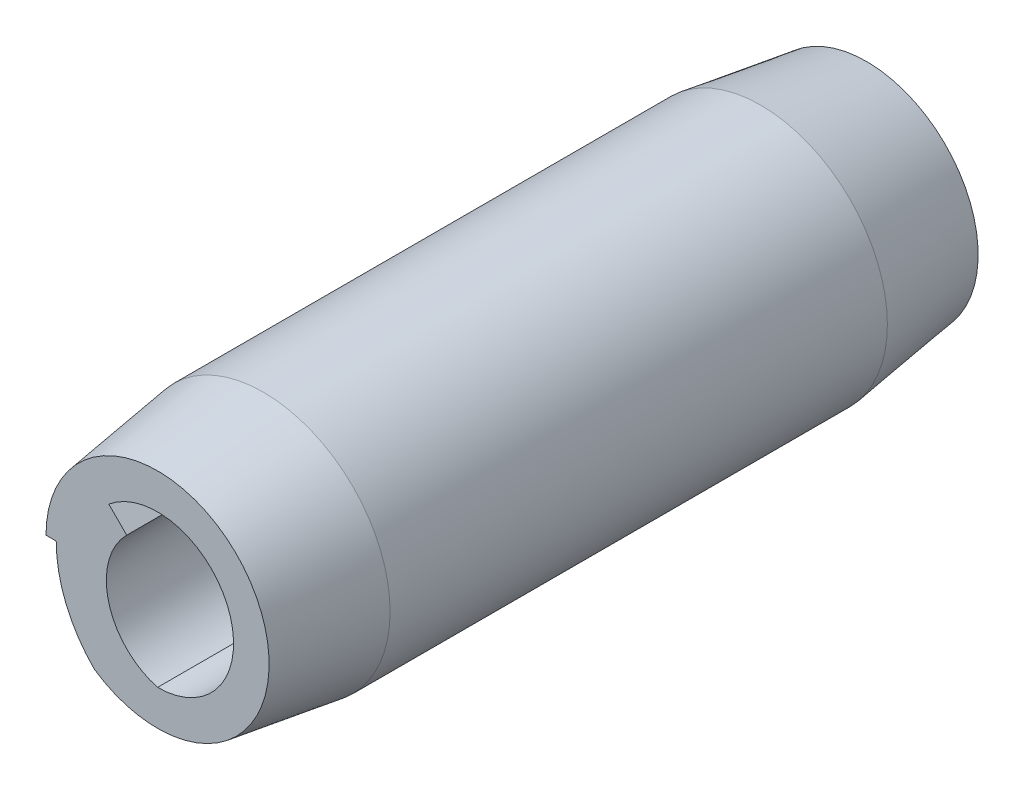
ISO-10303-21;
HEADER;
FILE_DESCRIPTION(('STEP AP214'),'2;1');
FILE_NAME('part.step','',(''),(''),'','','');
FILE_SCHEMA(('AUTOMOTIVE_DESIGN { 1 0 10303 214 1 1 1 1 }'));
ENDSEC;
DATA;
#1=APPLICATION_CONTEXT('core data for automotive mechanical design processes');
#2=APPLICATION_PROTOCOL_DEFINITION('international standard','automotive_design',2000,#1);
#3=PRODUCT_CONTEXT('',#1,'mechanical');
#4=PRODUCT('Part','Part','',(#3));
#5=PRODUCT_RELATED_PRODUCT_CATEGORY('part','',(#4));
#6=PRODUCT_DEFINITION_FORMATION('','',#4);
#7=PRODUCT_DEFINITION_CONTEXT('part definition',#1,'design');
#8=PRODUCT_DEFINITION('design','',#6,#7);
#9=PRODUCT_DEFINITION_SHAPE('','',#8);
#10=(LENGTH_UNIT() NAMED_UNIT(*) SI_UNIT(.MILLI.,.METRE.));
#11=(NAMED_UNIT(*) PLANE_ANGLE_UNIT() SI_UNIT($,.RADIAN.));
#12=(NAMED_UNIT(*) SI_UNIT($,.STERADIAN.) SOLID_ANGLE_UNIT());
#13=UNCERTAINTY_MEASURE_WITH_UNIT(LENGTH_MEASURE(1.E-05),#10,'distance_accuracy_value','');
#14=(GEOMETRIC_REPRESENTATION_CONTEXT(3) GLOBAL_UNCERTAINTY_ASSIGNED_CONTEXT((#13)) GLOBAL_UNIT_ASSIGNED_CONTEXT((#10,
#11,#12)) REPRESENTATION_CONTEXT('',''));
#15=CARTESIAN_POINT('',(0.,0.,0.));
#16=DIRECTION('',(0.,0.,1.));
#17=DIRECTION('',(1.,0.,0.));
#18=AXIS2_PLACEMENT_3D('',#15,#16,#17);
#19=CARTESIAN_POINT('',(0.,0.,2.38125));
#20=DIRECTION('',(0.,0.,-1.));
#21=DIRECTION('',(-1.,0.,0.));
#22=AXIS2_PLACEMENT_3D('',#19,#20,#21);
#23=PLANE('',#22);
#24=CARTESIAN_POINT('',(0.,0.,2.38125));
#25=DIRECTION('',(0.,0.,1.));
#26=DIRECTION('',(-1.,0.,0.));
#27=AXIS2_PLACEMENT_3D('',#24,#25,#26);
#28=CIRCLE('',#27,0.51054);
#29=CARTESIAN_POINT('',(0.,-0.51054,2.38125));
#30=VERTEX_POINT('',#29);
#31=CARTESIAN_POINT('',(-0.32748307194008,0.391670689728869,2.38125));
#32=VERTEX_POINT('',#31);
#33=EDGE_CURVE('E189',#30,#32,#28,.T.);
#34=ORIENTED_EDGE('',*,*,#33,.F.);
#35=CARTESIAN_POINT('',(0.123602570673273,-0.0594149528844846,2.38125));
#36=DIRECTION('',(0.,0.,1.));
#37=DIRECTION('',(-1.,0.,0.));
#38=AXIS2_PLACEMENT_3D('',#35,#36,#37);
#39=CIRCLE('',#38,0.467751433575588);
#40=CARTESIAN_POINT('',(-0.207147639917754,0.271335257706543,2.38125));
#41=VERTEX_POINT('',#40);
#42=EDGE_CURVE('E200',#41,#30,#39,.T.);
#43=ORIENTED_EDGE('',*,*,#42,.F.);
#44=DIRECTION('',(0.707106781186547,-0.707106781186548,0.));
#45=VECTOR('',#44,1.);
#46=CARTESIAN_POINT('',(-0.32748307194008,0.391670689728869,2.38125));
#47=LINE('',#46,#45);
#48=EDGE_CURVE('E188',#32,#41,#47,.T.);
#49=ORIENTED_EDGE('',*,*,#48,.F.);
#50=EDGE_LOOP('',(#34,#43,#49));
#51=FACE_BOUND('',#50,.T.);
#52=CARTESIAN_POINT('',(0.1914525,0.,2.38125));
#53=DIRECTION('',(0.,0.,1.));
#54=DIRECTION('',(-1.,0.,0.));
#55=AXIS2_PLACEMENT_3D('',#52,#53,#54);
#56=CIRCLE('',#55,0.8721725);
#57=CARTESIAN_POINT('',(-0.68072,0.,2.38125));
#58=VERTEX_POINT('',#57);
#59=CARTESIAN_POINT('',(-0.424597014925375,-0.617387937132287,2.38125));
#60=VERTEX_POINT('',#59);
#61=EDGE_CURVE('E140',#58,#60,#56,.T.);
#62=ORIENTED_EDGE('',*,*,#61,.T.);
#63=CARTESIAN_POINT('',(0.,0.,2.38125));
#64=DIRECTION('',(0.,0.,-1.));
#65=DIRECTION('',(-1.,0.,0.));
#66=AXIS2_PLACEMENT_3D('',#63,#64,#65);
#67=CIRCLE('',#66,0.7493);
#68=CARTESIAN_POINT('',(-0.7493,0.,2.38125));
#69=VERTEX_POINT('',#68);
#70=EDGE_CURVE('E58',#69,#60,#67,.T.);
#71=ORIENTED_EDGE('',*,*,#70,.F.);
#72=DIRECTION('',(1.,0.,0.));
#73=VECTOR('',#72,1.);
#74=CARTESIAN_POINT('',(-0.8509,0.,2.38125));
#75=LINE('',#74,#73);
#76=EDGE_CURVE('E135',#69,#58,#75,.T.);
#77=ORIENTED_EDGE('',*,*,#76,.T.);
#78=EDGE_LOOP('',(#62,#71,#77));
#79=FACE_BOUND('',#78,.T.);
#80=ADVANCED_FACE('F39',(#51,#79),#23,.F.);
#81=CARTESIAN_POINT('',(0.,0.,-2.38125));
#82=DIRECTION('',(0.,0.,-1.));
#83=DIRECTION('',(-1.,0.,0.));
#84=AXIS2_PLACEMENT_3D('',#81,#82,#83);
#85=PLANE('',#84);
#86=CARTESIAN_POINT('',(0.123602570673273,-0.0594149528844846,-2.38125));
#87=DIRECTION('',(0.,0.,1.));
#88=DIRECTION('',(-1.,0.,0.));
#89=AXIS2_PLACEMENT_3D('',#86,#87,#88);
#90=CIRCLE('',#89,0.467751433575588);
#91=CARTESIAN_POINT('',(-0.207147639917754,0.271335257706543,-2.38125));
#92=VERTEX_POINT('',#91);
#93=CARTESIAN_POINT('',(0.,-0.51054,-2.38125));
#94=VERTEX_POINT('',#93);
#95=EDGE_CURVE('E183',#92,#94,#90,.T.);
#96=ORIENTED_EDGE('',*,*,#95,.T.);
#97=CARTESIAN_POINT('',(0.,0.,-2.38125));
#98=DIRECTION('',(0.,0.,1.));
#99=DIRECTION('',(-1.,0.,0.));
#100=AXIS2_PLACEMENT_3D('',#97,#98,#99);
#101=CIRCLE('',#100,0.51054);
#102=CARTESIAN_POINT('',(-0.32748307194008,0.391670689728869,-2.38125));
#103=VERTEX_POINT('',#102);
#104=EDGE_CURVE('E184',#94,#103,#101,.T.);
#105=ORIENTED_EDGE('',*,*,#104,.T.);
#106=DIRECTION('',(0.707106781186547,-0.707106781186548,0.));
#107=VECTOR('',#106,1.);
#108=CARTESIAN_POINT('',(-0.32748307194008,0.391670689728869,-2.38125));
#109=LINE('',#108,#107);
#110=EDGE_CURVE('E187',#103,#92,#109,.T.);
#111=ORIENTED_EDGE('',*,*,#110,.T.);
#112=EDGE_LOOP('',(#96,#105,#111));
#113=FACE_BOUND('',#112,.T.);
#114=CARTESIAN_POINT('',(0.,0.,-2.38125));
#115=DIRECTION('',(0.,0.,-1.));
#116=DIRECTION('',(-1.,0.,0.));
#117=AXIS2_PLACEMENT_3D('',#114,#115,#116);
#118=CIRCLE('',#117,0.7493);
#119=CARTESIAN_POINT('',(-0.7493,0.,-2.38125));
#120=VERTEX_POINT('',#119);
#121=CARTESIAN_POINT('',(-0.424597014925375,-0.617387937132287,-2.38125));
#122=VERTEX_POINT('',#121);
#123=EDGE_CURVE('E110',#120,#122,#118,.T.);
#124=ORIENTED_EDGE('',*,*,#123,.T.);
#125=CARTESIAN_POINT('',(0.1914525,0.,-2.38125));
#126=DIRECTION('',(0.,0.,1.));
#127=DIRECTION('',(-1.,0.,0.));
#128=AXIS2_PLACEMENT_3D('',#125,#126,#127);
#129=CIRCLE('',#128,0.8721725);
#130=CARTESIAN_POINT('',(-0.68072,0.,-2.38125));
#131=VERTEX_POINT('',#130);
#132=EDGE_CURVE('E126',#131,#122,#129,.T.);
#133=ORIENTED_EDGE('',*,*,#132,.F.);
#134=DIRECTION('',(1.,0.,0.));
#135=VECTOR('',#134,1.);
#136=CARTESIAN_POINT('',(-0.8509,0.,-2.38125));
#137=LINE('',#136,#135);
#138=EDGE_CURVE('E122',#120,#131,#137,.T.);
#139=ORIENTED_EDGE('',*,*,#138,.F.);
#140=EDGE_LOOP('',(#124,#133,#139));
#141=FACE_BOUND('',#140,.T.);
#142=ADVANCED_FACE('F129',(#113,#141),#85,.T.);
#143=CARTESIAN_POINT('',(0.,0.,2.38125));
#144=DIRECTION('',(0.,0.,-1.));
#145=DIRECTION('',(-1.,0.,0.));
#146=AXIS2_PLACEMENT_3D('',#143,#144,#145);
#147=CYLINDRICAL_SURFACE('',#146,0.8509);
#148=DIRECTION('',(0.,0.,-1.));
#149=VECTOR('',#148,1.);
#150=CARTESIAN_POINT('',(-0.8509,0.,2.38125));
#151=LINE('',#150,#149);
#152=CARTESIAN_POINT('',(-0.8509,0.,1.67005));
#153=VERTEX_POINT('',#152);
#154=CARTESIAN_POINT('',(-0.8509,0.,-1.67005));
#155=VERTEX_POINT('',#154);
#156=EDGE_CURVE('E123',#153,#155,#151,.T.);
#157=ORIENTED_EDGE('',*,*,#156,.F.);
#158=CARTESIAN_POINT('',(0.,0.,1.67005));
#159=DIRECTION('',(0.,0.,-1.));
#160=DIRECTION('',(-1.,0.,0.));
#161=AXIS2_PLACEMENT_3D('',#158,#159,#160);
#162=CIRCLE('',#161,0.8509);
#163=CARTESIAN_POINT('',(0.,-0.8509,1.67005));
#164=VERTEX_POINT('',#163);
#165=EDGE_CURVE('E203',#153,#164,#162,.T.);
#166=ORIENTED_EDGE('',*,*,#165,.T.);
#167=DIRECTION('',(0.,0.,-1.));
#168=VECTOR('',#167,1.);
#169=CARTESIAN_POINT('',(0.,-0.8509,2.38125));
#170=LINE('',#169,#168);
#171=CARTESIAN_POINT('',(0.,-0.8509,-1.67005));
#172=VERTEX_POINT('',#171);
#173=EDGE_CURVE('E142',#164,#172,#170,.T.);
#174=ORIENTED_EDGE('',*,*,#173,.T.);
#175=CARTESIAN_POINT('',(0.,0.,-1.67005));
#176=DIRECTION('',(0.,0.,-1.));
#177=DIRECTION('',(-1.,0.,0.));
#178=AXIS2_PLACEMENT_3D('',#175,#176,#177);
#179=CIRCLE('',#178,0.8509);
#180=EDGE_CURVE('E70',#155,#172,#179,.T.);
#181=ORIENTED_EDGE('',*,*,#180,.F.);
#182=EDGE_LOOP('',(#157,#166,#174,#181));
#183=FACE_BOUND('',#182,.T.);
#184=ADVANCED_FACE('F41',(#183),#147,.T.);
#185=CARTESIAN_POINT('',(-0.8509,0.,2.38125));
#186=DIRECTION('',(0.,1.,0.));
#187=DIRECTION('',(0.,0.,1.));
#188=AXIS2_PLACEMENT_3D('',#185,#186,#187);
#189=PLANE('',#188);
#190=ORIENTED_EDGE('',*,*,#76,.F.);
#191=DIRECTION('',(0.14142135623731,0.,0.989949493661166));
#192=VECTOR('',#191,1.);
#193=CARTESIAN_POINT('',(0.,0.,7.62634999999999));
#194=LINE('',#193,#192);
#195=EDGE_CURVE('E127',#69,#153,#194,.F.);
#196=ORIENTED_EDGE('',*,*,#195,.T.);
#197=ORIENTED_EDGE('',*,*,#156,.T.);
#198=DIRECTION('',(-0.14142135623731,0.,0.989949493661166));
#199=VECTOR('',#198,1.);
#200=CARTESIAN_POINT('',(0.,0.,-7.62634999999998));
#201=LINE('',#200,#199);
#202=EDGE_CURVE('E109',#155,#120,#201,.F.);
#203=ORIENTED_EDGE('',*,*,#202,.T.);
#204=ORIENTED_EDGE('',*,*,#138,.T.);
#205=DIRECTION('',(0.,0.,-1.));
#206=VECTOR('',#205,1.);
#207=CARTESIAN_POINT('',(-0.68072,0.,2.38125));
#208=LINE('',#207,#206);
#209=EDGE_CURVE('E144',#58,#131,#208,.T.);
#210=ORIENTED_EDGE('',*,*,#209,.F.);
#211=EDGE_LOOP('',(#190,#196,#197,#203,#204,#210));
#212=FACE_BOUND('',#211,.T.);
#213=ADVANCED_FACE('F118',(#212),#189,.F.);
#214=CARTESIAN_POINT('',(0.1914525,0.,2.38125));
#215=DIRECTION('',(0.,0.,-1.));
#216=DIRECTION('',(-1.,0.,0.));
#217=AXIS2_PLACEMENT_3D('',#214,#215,#216);
#218=CYLINDRICAL_SURFACE('',#217,0.8721725);
#219=ORIENTED_EDGE('',*,*,#173,.F.);
#220=CARTESIAN_POINT('',(0.000126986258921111,-0.85092856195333,1.66984999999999));
#221=CARTESIAN_POINT('',(-0.0335283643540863,-0.843337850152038,1.72285012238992));
#222=CARTESIAN_POINT('',(-0.0667397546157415,-0.833794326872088,1.77586877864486));
#223=CARTESIAN_POINT('',(-0.132188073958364,-0.810653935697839,1.88177479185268));
#224=CARTESIAN_POINT('',(-0.164422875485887,-0.797048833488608,1.93466165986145));
#225=CARTESIAN_POINT('',(-0.227263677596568,-0.765880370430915,2.03920317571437));
#226=CARTESIAN_POINT('',(-0.257885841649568,-0.74837320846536,2.09086480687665));
#227=CARTESIAN_POINT('',(-0.317751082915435,-0.709000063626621,2.19326912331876));
#228=CARTESIAN_POINT('',(-0.346995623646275,-0.687138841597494,2.24401274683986));
#229=CARTESIAN_POINT('',(-0.383773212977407,-0.655683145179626,2.30871504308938));
#230=CARTESIAN_POINT('',(-0.392057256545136,-0.648325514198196,2.32335004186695));
#231=CARTESIAN_POINT('',(-0.408490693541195,-0.633149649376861,2.35250141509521));
#232=CARTESIAN_POINT('',(-0.416639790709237,-0.625330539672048,2.36701750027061));
#233=CARTESIAN_POINT('',(-0.424708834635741,-0.617276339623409,2.38145000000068));
#234=B_SPLINE_CURVE_WITH_KNOTS('',3,(#220,#221,#222,#223,#224,#225,#226,#227,#228,#229,#230,
#231,#232,#233),.UNSPECIFIED.,.F.,.F.,(4,2,2,2,2,2,4),(0.,0.189709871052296,0.379806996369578,
0.5673253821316,0.754639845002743,0.809702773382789,0.864873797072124),.UNSPECIFIED.);
#235=EDGE_CURVE('E11',#164,#60,#234,.T.);
#236=ORIENTED_EDGE('',*,*,#235,.T.);
#237=ORIENTED_EDGE('',*,*,#61,.F.);
#238=ORIENTED_EDGE('',*,*,#209,.T.);
#239=ORIENTED_EDGE('',*,*,#132,.T.);
#240=CARTESIAN_POINT('',(-0.424708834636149,-0.617276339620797,-2.38144999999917));
#241=CARTESIAN_POINT('',(-0.4088221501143,-0.633124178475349,-2.35303341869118));
#242=CARTESIAN_POINT('',(-0.392630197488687,-0.648073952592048,-2.3243042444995));
#243=CARTESIAN_POINT('',(-0.359701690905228,-0.676303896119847,-2.26635946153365));
#244=CARTESIAN_POINT('',(-0.342965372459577,-0.68958477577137,-2.23714406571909));
#245=CARTESIAN_POINT('',(-0.292251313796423,-0.726960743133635,-2.14934370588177));
#246=CARTESIAN_POINT('',(-0.257548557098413,-0.74880307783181,-2.09021068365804));
#247=CARTESIAN_POINT('',(-0.186592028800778,-0.787014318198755,-1.97125162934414));
#248=CARTESIAN_POINT('',(-0.150340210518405,-0.803389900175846,-1.91142653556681));
#249=CARTESIAN_POINT('',(-0.0762165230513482,-0.831019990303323,-1.79101078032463));
#250=CARTESIAN_POINT('',(-0.0383353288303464,-0.842238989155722,-1.73041767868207));
#251=CARTESIAN_POINT('',(0.000126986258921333,-0.85092856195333,-1.66984999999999));
#252=B_SPLINE_CURVE_WITH_KNOTS('',3,(#240,#241,#242,#243,#244,#245,#246,#247,#248,#249,#250,
#251),.UNSPECIFIED.,.F.,.F.,(4,2,2,2,2,4),(0.,0.108588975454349,0.217131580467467,
0.43272503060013,0.648054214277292,0.864844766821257),.UNSPECIFIED.);
#253=EDGE_CURVE('E52',#122,#172,#252,.T.);
#254=ORIENTED_EDGE('',*,*,#253,.T.);
#255=EDGE_LOOP('',(#219,#236,#237,#238,#239,#254));
#256=FACE_BOUND('',#255,.T.);
#257=ADVANCED_FACE('F151',(#256),#218,.T.);
#258=CARTESIAN_POINT('',(0.,0.,2.38125));
#259=DIRECTION('',(0.,0.,-1.));
#260=DIRECTION('',(-1.,0.,0.));
#261=AXIS2_PLACEMENT_3D('',#258,#259,#260);
#262=CYLINDRICAL_SURFACE('',#261,0.51054);
#263=ORIENTED_EDGE('',*,*,#104,.F.);
#264=DIRECTION('',(0.,0.,-1.));
#265=VECTOR('',#264,1.);
#266=CARTESIAN_POINT('',(0.,-0.51054,2.38125));
#267=LINE('',#266,#265);
#268=EDGE_CURVE('E193',#30,#94,#267,.T.);
#269=ORIENTED_EDGE('',*,*,#268,.F.);
#270=ORIENTED_EDGE('',*,*,#33,.T.);
#271=DIRECTION('',(0.,0.,-1.));
#272=VECTOR('',#271,1.);
#273=CARTESIAN_POINT('',(-0.32748307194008,0.391670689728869,2.38125));
#274=LINE('',#273,#272);
#275=EDGE_CURVE('E128',#32,#103,#274,.T.);
#276=ORIENTED_EDGE('',*,*,#275,.T.);
#277=EDGE_LOOP('',(#263,#269,#270,#276));
#278=FACE_BOUND('',#277,.T.);
#279=ADVANCED_FACE('F170',(#278),#262,.F.);
#280=CARTESIAN_POINT('',(-0.32748307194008,0.391670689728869,2.38125));
#281=DIRECTION('',(0.707106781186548,0.707106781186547,0.));
#282=DIRECTION('',(-0.707106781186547,0.707106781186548,0.));
#283=AXIS2_PLACEMENT_3D('',#280,#281,#282);
#284=PLANE('',#283);
#285=ORIENTED_EDGE('',*,*,#110,.F.);
#286=ORIENTED_EDGE('',*,*,#275,.F.);
#287=ORIENTED_EDGE('',*,*,#48,.T.);
#288=DIRECTION('',(0.,0.,-1.));
#289=VECTOR('',#288,1.);
#290=CARTESIAN_POINT('',(-0.207147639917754,0.271335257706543,2.38125));
#291=LINE('',#290,#289);
#292=EDGE_CURVE('E134',#41,#92,#291,.T.);
#293=ORIENTED_EDGE('',*,*,#292,.T.);
#294=EDGE_LOOP('',(#285,#286,#287,#293));
#295=FACE_BOUND('',#294,.T.);
#296=ADVANCED_FACE('F161',(#295),#284,.T.);
#297=CARTESIAN_POINT('',(0.123602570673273,-0.0594149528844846,2.38125));
#298=DIRECTION('',(0.,0.,-1.));
#299=DIRECTION('',(-1.,0.,0.));
#300=AXIS2_PLACEMENT_3D('',#297,#298,#299);
#301=CYLINDRICAL_SURFACE('',#300,0.467751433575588);
#302=ORIENTED_EDGE('',*,*,#95,.F.);
#303=ORIENTED_EDGE('',*,*,#292,.F.);
#304=ORIENTED_EDGE('',*,*,#42,.T.);
#305=ORIENTED_EDGE('',*,*,#268,.T.);
#306=EDGE_LOOP('',(#302,#303,#304,#305));
#307=FACE_BOUND('',#306,.T.);
#308=ADVANCED_FACE('F156',(#307),#301,.F.);
#309=CARTESIAN_POINT('',(0.,0.,-1.67005));
#310=DIRECTION('',(0.,0.,1.));
#311=DIRECTION('',(1.,0.,0.));
#312=AXIS2_PLACEMENT_3D('',#309,#310,#311);
#313=CONICAL_SURFACE('',#312,0.8509,0.141897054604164);
#314=ORIENTED_EDGE('',*,*,#180,.T.);
#315=ORIENTED_EDGE('',*,*,#253,.F.);
#316=ORIENTED_EDGE('',*,*,#123,.F.);
#317=ORIENTED_EDGE('',*,*,#202,.F.);
#318=EDGE_LOOP('',(#314,#315,#316,#317));
#319=FACE_BOUND('',#318,.T.);
#320=ADVANCED_FACE('F107',(#319),#313,.T.);
#321=CARTESIAN_POINT('',(0.,0.,2.38125));
#322=DIRECTION('',(0.,0.,-1.));
#323=DIRECTION('',(-1.,0.,0.));
#324=AXIS2_PLACEMENT_3D('',#321,#322,#323);
#325=CONICAL_SURFACE('',#324,0.7493,0.141897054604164);
#326=ORIENTED_EDGE('',*,*,#70,.T.);
#327=ORIENTED_EDGE('',*,*,#235,.F.);
#328=ORIENTED_EDGE('',*,*,#165,.F.);
#329=ORIENTED_EDGE('',*,*,#195,.F.);
#330=EDGE_LOOP('',(#326,#327,#328,#329));
#331=FACE_BOUND('',#330,.T.);
#332=ADVANCED_FACE('F159',(#331),#325,.T.);
#333=CLOSED_SHELL('',(#80,#142,#184,#213,#257,#279,#296,#308,#320,#332));
#334=MANIFOLD_SOLID_BREP('B2',#333);
#335=ADVANCED_BREP_SHAPE_REPRESENTATION('',(#18,#334),#14);
#336=SHAPE_DEFINITION_REPRESENTATION(#9,#335);
ENDSEC;
END-ISO-10303-21;
